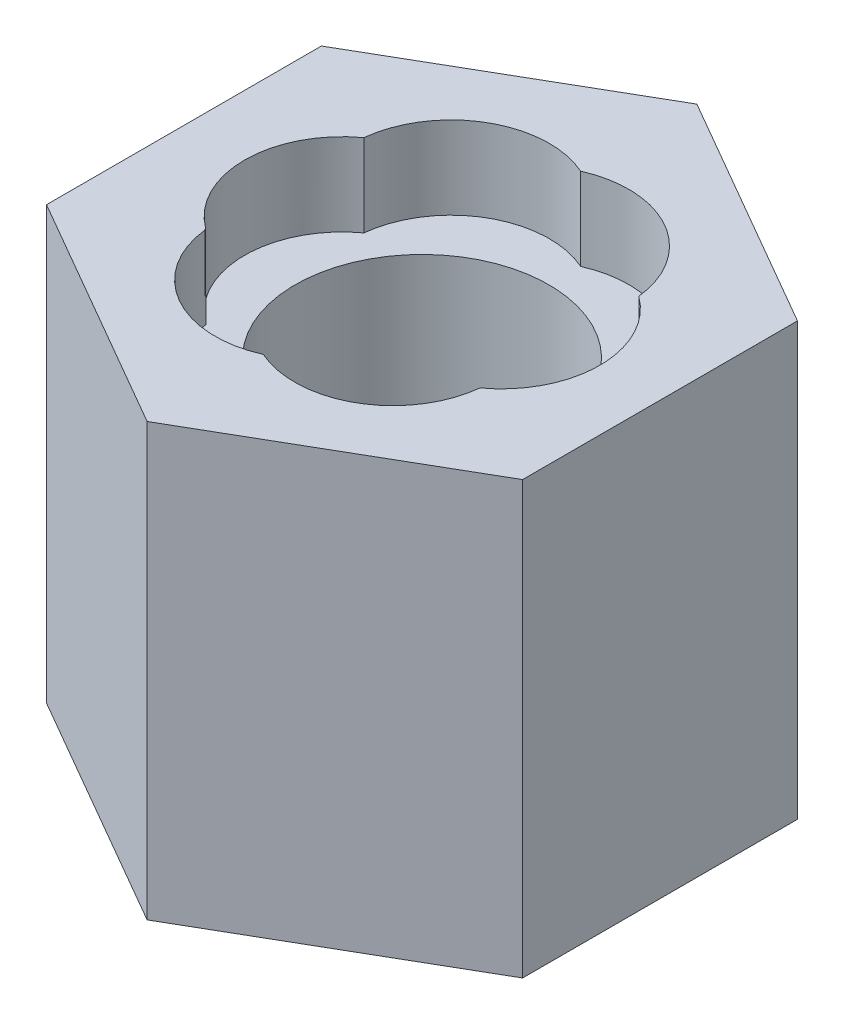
from build123d import *

# Parameters (mm, degrees)
SKETCH1_R           = 12.5
SKETCH1_R_2         = 10
BOSS_EXTRUDE5_DEPTH = 34
CUT_EXTRUDE2_DEPTH  = 24
SKETCH4_R           = 12.5
CUT_EXTRUDE3_DEPTH  = 4
SKETCH5_R           = 10
CUT_EXTRUDE7_DEPTH  = 10
SKETCH9_R           = 12.5
CUT_EXTRUDE8_DEPTH  = 0.5
CUT_EXTRUDE9_DEPTH  = 6.5


with BuildPart() as part:
    # Sketch1 → Boss-Extrude5 (new body)
    # profile 1 of 3: a face of its own
    with BuildSketch(Plane(origin=(0, 0, 0), x_dir=(1, 0, 0), z_dir=(0, 1, 0))):
        Polygon((56.25, 75.775317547), (37.5, 86.600635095), (18.75, 75.775317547), (18.75, 54.124682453), (37.5, 43.299364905), (56.25, 54.124682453), align=None)
        with Locations((37.5, 64.95)):
            Circle(SKETCH1_R, mode=Mode.SUBTRACT)
    # profile 2 of 3: a face of its own
    with BuildSketch(Plane(origin=(0, 0, 0), x_dir=(1, 0, 0), z_dir=(0, 1, 0))):
        with Locations((37.5, 64.95)):
            Circle(SKETCH1_R)
        with Locations((37.5, 64.95)):
            Circle(SKETCH1_R_2, mode=Mode.SUBTRACT)
    # profile 3 of 3: a face of its own
    with BuildSketch(Plane(origin=(0, 0, 0), x_dir=(1, 0, 0), z_dir=(0, 1, 0))):
        with Locations((37.5, 64.95)):
            Circle(SKETCH1_R_2)
    extrude(amount=BOSS_EXTRUDE5_DEPTH)

    # Sketch3 → Cut-Extrude2 (cut)
    with BuildSketch(Plane(origin=(0, 34, 0), x_dir=(1, 0, 0), z_dir=(0, 1, 0))):
        with BuildLine():
            ThreePointArc((46.160254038, 69.95), (37.5, 74.95), (28.839745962, 69.95))
            Line((28.839745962, 69.95), (37.5, 64.95))
            Line((37.5, 64.95), (46.160254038, 69.95))
        make_face()
        with BuildLine():
            Line((37.5, 64.95), (28.839745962, 69.95))
            ThreePointArc((28.839745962, 69.95), (27.5, 64.95), (28.839745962, 59.95))
            Line((28.839745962, 59.95), (37.5, 64.95))
        make_face()
        with BuildLine():
            Line((46.160254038, 69.95), (37.5, 64.95))
            Line((37.5, 64.95), (46.160254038, 59.95))
            ThreePointArc((46.160254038, 59.95), (47.159258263, 62.361809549), (47.5, 64.95))
            ThreePointArc((47.5, 64.95), (47.159258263, 67.538190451), (46.160254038, 69.95))
        make_face()
        with BuildLine():
            Line((46.160254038, 59.95), (37.5, 64.95))
            Line((37.5, 64.95), (28.839745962, 59.95))
            ThreePointArc((28.839745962, 59.95), (37.5, 54.95), (46.160254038, 59.95))
        make_face()
        with BuildLine():
            ThreePointArc((46.160254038, 69.95), (37.5, 74.95), (28.839745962, 69.95))
            Line((28.839745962, 69.95), (37.5, 64.95))
            Line((37.5, 64.95), (46.160254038, 69.95))
        make_face()
        with BuildLine():
            Line((37.5, 64.95), (28.839745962, 69.95))
            ThreePointArc((28.839745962, 69.95), (27.5, 64.95), (28.839745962, 59.95))
            Line((28.839745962, 59.95), (37.5, 64.95))
        make_face()
        with BuildLine():
            Line((46.160254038, 69.95), (37.5, 64.95))
            Line((37.5, 64.95), (46.160254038, 59.95))
            ThreePointArc((46.160254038, 59.95), (47.159258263, 62.361809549), (47.5, 64.95))
            ThreePointArc((47.5, 64.95), (47.159258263, 67.538190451), (46.160254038, 69.95))
        make_face()
        with BuildLine():
            Line((46.160254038, 59.95), (37.5, 64.95))
            Line((37.5, 64.95), (28.839745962, 59.95))
            ThreePointArc((28.839745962, 59.95), (37.5, 54.95), (46.160254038, 59.95))
        make_face()
        with BuildLine():
            ThreePointArc((46.160254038, 69.95), (37.5, 74.95), (28.839745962, 69.95))
            Line((28.839745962, 69.95), (37.5, 64.95))
            Line((37.5, 64.95), (46.160254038, 69.95))
        make_face()
        with BuildLine():
            Line((37.5, 64.95), (28.839745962, 69.95))
            ThreePointArc((28.839745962, 69.95), (27.5, 64.95), (28.839745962, 59.95))
            Line((28.839745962, 59.95), (37.5, 64.95))
        make_face()
        with BuildLine():
            Line((46.160254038, 69.95), (37.5, 64.95))
            Line((37.5, 64.95), (46.160254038, 59.95))
            ThreePointArc((46.160254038, 59.95), (47.159258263, 62.361809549), (47.5, 64.95))
            ThreePointArc((47.5, 64.95), (47.159258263, 67.538190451), (46.160254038, 69.95))
        make_face()
        with BuildLine():
            Line((46.160254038, 59.95), (37.5, 64.95))
            Line((37.5, 64.95), (28.839745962, 59.95))
            ThreePointArc((28.839745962, 59.95), (37.5, 54.95), (46.160254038, 59.95))
        make_face()
        with BuildLine():
            ThreePointArc((46.160254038, 69.95), (37.5, 74.95), (28.839745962, 69.95))
            Line((28.839745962, 69.95), (37.5, 64.95))
            Line((37.5, 64.95), (46.160254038, 69.95))
        make_face()
        with BuildLine():
            Line((37.5, 64.95), (28.839745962, 69.95))
            ThreePointArc((28.839745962, 69.95), (27.5, 64.95), (28.839745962, 59.95))
            Line((28.839745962, 59.95), (37.5, 64.95))
        make_face()
        with BuildLine():
            Line((46.160254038, 69.95), (37.5, 64.95))
            Line((37.5, 64.95), (46.160254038, 59.95))
            ThreePointArc((46.160254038, 59.95), (47.159258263, 62.361809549), (47.5, 64.95))
            ThreePointArc((47.5, 64.95), (47.159258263, 67.538190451), (46.160254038, 69.95))
        make_face()
        with BuildLine():
            Line((46.160254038, 59.95), (37.5, 64.95))
            Line((37.5, 64.95), (28.839745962, 59.95))
            ThreePointArc((28.839745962, 59.95), (37.5, 54.95), (46.160254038, 59.95))
        make_face()
    extrude(amount=-CUT_EXTRUDE2_DEPTH, mode=Mode.SUBTRACT)

    # Sketch4 → Cut-Extrude3 (cut)
    with BuildSketch(Plane(origin=(0, 34, 0), x_dir=(1, 0, 0), z_dir=(0, 1, 0))):
        with Locations(Location((37.5, 64.95, 0), (0, 0, 270))):
            Circle(SKETCH4_R)
    extrude(amount=-CUT_EXTRUDE3_DEPTH, mode=Mode.SUBTRACT)

    # Sketch5 → Cut-Extrude7 (cut)
    with BuildSketch(Plane(origin=(0, 10, 0), x_dir=(1, 0, 0), z_dir=(0, 1, 0))):
        with Locations(Location((37.5, 64.95, 0), (0, 0, 270))):
            Circle(SKETCH5_R)
    extrude(amount=-CUT_EXTRUDE7_DEPTH, mode=Mode.SUBTRACT)

    # Sketch9 → Cut-Extrude8 (cut)
    with BuildSketch(Plane(origin=(0, 30, 0), x_dir=(-1, 0, 0), z_dir=(0, 1, 0))):
        with Locations(Location((-37.5, -64.95, 0), (0, 0, 90))):
            Circle(SKETCH9_R)
    extrude(amount=-CUT_EXTRUDE8_DEPTH, mode=Mode.SUBTRACT)

    # Sketch10 → Cut-Extrude9 (cut)
    with BuildSketch(Plane(origin=(0, 34, 0), x_dir=(-1, 0, 0), z_dir=(0, 1, 0))):
        with BuildLine():
            ThreePointArc((-37.5, -77.45), (-30.5, -77.074355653), (-26.674682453, -71.2))
            ThreePointArc((-26.674682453, -71.2), (-31.25, -75.775317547), (-37.5, -77.45))
        make_face()
        with BuildLine():
            ThreePointArc((-48.325317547, -71.2), (-44.5, -77.074355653), (-37.5, -77.45))
            ThreePointArc((-37.5, -77.45), (-43.75, -75.775317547), (-48.325317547, -71.2))
        make_face()
        with BuildLine():
            ThreePointArc((-48.325317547, -58.7), (-51.5, -64.95), (-48.325317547, -71.2))
            ThreePointArc((-48.325317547, -71.2), (-50, -64.95), (-48.325317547, -58.7))
        make_face()
        with BuildLine():
            ThreePointArc((-37.5, -52.45), (-44.5, -52.825644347), (-48.325317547, -58.7))
            ThreePointArc((-48.325317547, -58.7), (-43.75, -54.124682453), (-37.5, -52.45))
        make_face()
        with BuildLine():
            ThreePointArc((-37.5, -52.45), (-31.289509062, -54.101967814), (-26.720543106, -58.621231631))
            ThreePointArc((-26.720543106, -58.621231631), (-30.544250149, -52.800203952), (-37.5, -52.45))
        make_face()
        with BuildLine():
            ThreePointArc((-25, -64.95), (-25.425927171, -68.185238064), (-26.674682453, -71.2))
            ThreePointArc((-26.674682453, -71.2), (-23.500093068, -65.001048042), (-26.629392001, -58.779110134))
            ThreePointArc((-26.629392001, -58.779110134), (-25.414210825, -61.758808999), (-25, -64.95))
        make_face()
        with BuildLine():
            Line((-28.839745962, -69.95), (-26.674682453, -71.2))
            ThreePointArc((-26.674682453, -71.2), (-25.425927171, -68.185238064), (-25, -64.95))
            ThreePointArc((-25, -64.95), (-25.414210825, -61.758808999), (-26.629392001, -58.779110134))
            ThreePointArc((-26.629392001, -58.779110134), (-26.669641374, -58.749646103), (-26.71008091, -58.720443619))
            Line((-26.71008091, -58.720443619), (-28.839743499, -59.950004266))
            ThreePointArc((-28.839743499, -59.950004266), (-27.8407411, -62.361811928), (-27.5, -64.95))
            ThreePointArc((-27.5, -64.95), (-27.840741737, -67.538190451), (-28.839745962, -69.95))
        make_face()
        with BuildLine():
            ThreePointArc((-37.5, -77.45), (-31.25, -75.775317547), (-26.674682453, -71.2))
            Line((-26.674682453, -71.2), (-28.839745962, -69.95))
            ThreePointArc((-28.839745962, -69.95), (-32.5, -73.610254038), (-37.5, -74.95))
            Line((-37.5, -74.95), (-37.5, -77.074355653))
            Line((-37.5, -77.074355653), (-37.5, -77.45))
        make_face()
        with BuildLine():
            ThreePointArc((-48.325317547, -71.2), (-43.75, -75.775317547), (-37.5, -77.45))
            Line((-37.5, -77.45), (-37.5, -77.074355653))
            Line((-37.5, -77.074355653), (-37.5, -74.95))
            ThreePointArc((-37.5, -74.95), (-42.499999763, -73.610254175), (-46.160253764, -69.950000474))
            Line((-46.160253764, -69.950000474), (-48.325317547, -71.2))
        make_face()
        with BuildLine():
            ThreePointArc((-48.325317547, -58.7), (-50, -64.95), (-48.325317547, -71.2))
            Line((-48.325317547, -71.2), (-46.160253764, -69.950000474))
            ThreePointArc((-46.160253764, -69.950000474), (-47.5, -64.950000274), (-46.160254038, -59.95))
            Line((-46.160254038, -59.95), (-48.325317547, -58.7))
        make_face()
        with BuildLine():
            Line((-48.325317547, -58.7), (-46.160254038, -59.95))
            ThreePointArc((-46.160254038, -59.95), (-42.5, -56.289745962), (-37.5, -54.95))
            Line((-37.5, -54.95), (-37.5, -52.45))
            ThreePointArc((-37.5, -52.45), (-43.75, -54.124682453), (-48.325317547, -58.7))
        make_face()
        with BuildLine():
            ThreePointArc((-26.71008091, -58.720443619), (-26.715151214, -58.670820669), (-26.720543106, -58.621231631))
            ThreePointArc((-26.720543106, -58.621231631), (-31.289509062, -54.101967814), (-37.5, -52.45))
            Line((-37.5, -52.45), (-37.5, -54.95))
            ThreePointArc((-37.5, -54.95), (-32.499997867, -56.289747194), (-28.839743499, -59.950004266))
            Line((-28.839743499, -59.950004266), (-26.71008091, -58.720443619))
        make_face()
    extrude(amount=-CUT_EXTRUDE9_DEPTH, mode=Mode.SUBTRACT)


solid = part.part
